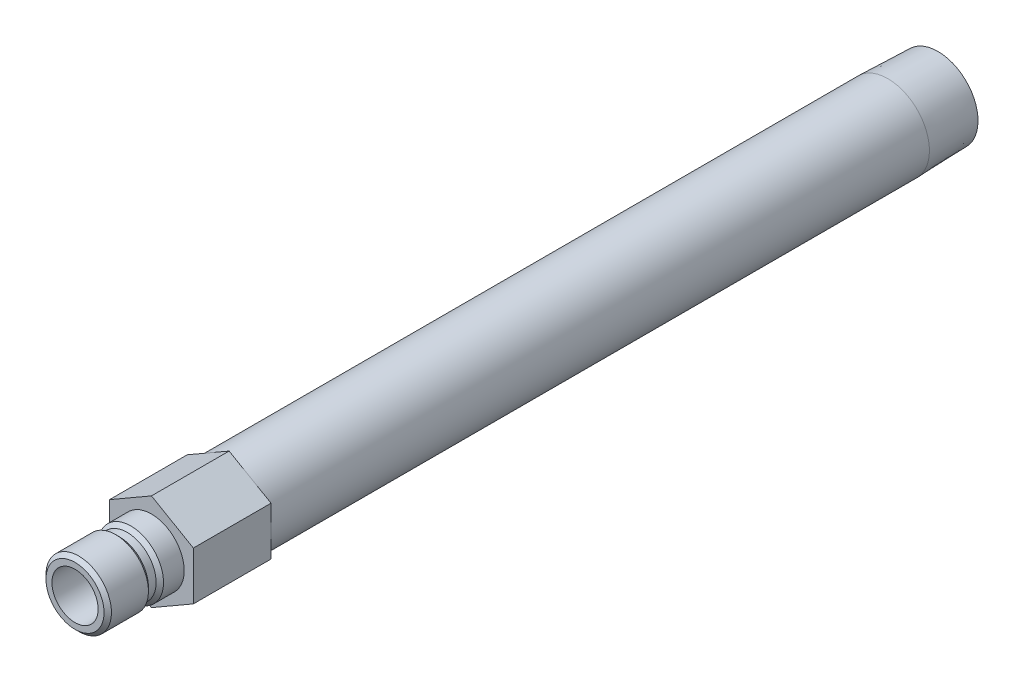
ISO-10303-21;
HEADER;
FILE_DESCRIPTION(('STEP AP214'),'2;1');
FILE_NAME('part.step','',(''),(''),'','','');
FILE_SCHEMA(('AUTOMOTIVE_DESIGN { 1 0 10303 214 1 1 1 1 }'));
ENDSEC;
DATA;
#1=APPLICATION_CONTEXT('core data for automotive mechanical design processes');
#2=APPLICATION_PROTOCOL_DEFINITION('international standard','automotive_design',2000,#1);
#3=PRODUCT_CONTEXT('',#1,'mechanical');
#4=PRODUCT('Part','Part','',(#3));
#5=PRODUCT_RELATED_PRODUCT_CATEGORY('part','',(#4));
#6=PRODUCT_DEFINITION_FORMATION('','',#4);
#7=PRODUCT_DEFINITION_CONTEXT('part definition',#1,'design');
#8=PRODUCT_DEFINITION('design','',#6,#7);
#9=PRODUCT_DEFINITION_SHAPE('','',#8);
#10=(LENGTH_UNIT() NAMED_UNIT(*) SI_UNIT(.MILLI.,.METRE.));
#11=(NAMED_UNIT(*) PLANE_ANGLE_UNIT() SI_UNIT($,.RADIAN.));
#12=(NAMED_UNIT(*) SI_UNIT($,.STERADIAN.) SOLID_ANGLE_UNIT());
#13=UNCERTAINTY_MEASURE_WITH_UNIT(LENGTH_MEASURE(1.E-05),#10,'distance_accuracy_value','');
#14=(GEOMETRIC_REPRESENTATION_CONTEXT(3) GLOBAL_UNCERTAINTY_ASSIGNED_CONTEXT((#13)) GLOBAL_UNIT_ASSIGNED_CONTEXT((#10,
#11,#12)) REPRESENTATION_CONTEXT('',''));
#15=CARTESIAN_POINT('',(0.,0.,0.));
#16=DIRECTION('',(0.,0.,1.));
#17=DIRECTION('',(1.,0.,0.));
#18=AXIS2_PLACEMENT_3D('',#15,#16,#17);
#19=CARTESIAN_POINT('',(0.,0.,0.));
#20=DIRECTION('',(0.,0.,-1.));
#21=DIRECTION('',(0.,1.,0.));
#22=AXIS2_PLACEMENT_3D('',#19,#20,#21);
#23=CYLINDRICAL_SURFACE('',#22,8.57249999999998);
#24=CARTESIAN_POINT('',(0.,0.,-151.7142));
#25=DIRECTION('',(0.,0.,-1.));
#26=DIRECTION('',(0.,1.,0.));
#27=AXIS2_PLACEMENT_3D('',#24,#25,#26);
#28=CIRCLE('',#27,8.57249999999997);
#29=CARTESIAN_POINT('',(0.,8.5725,-151.7142));
#30=VERTEX_POINT('',#29);
#31=EDGE_CURVE('E168',#30,#30,#28,.T.);
#32=ORIENTED_EDGE('',*,*,#31,.F.);
#33=EDGE_LOOP('',(#32));
#34=FACE_BOUND('',#33,.T.);
#35=CARTESIAN_POINT('',(0.,0.,-16.002));
#36=DIRECTION('',(0.,0.,1.));
#37=DIRECTION('',(1.,0.,0.));
#38=AXIS2_PLACEMENT_3D('',#35,#36,#37);
#39=CIRCLE('',#38,8.57249999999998);
#40=CARTESIAN_POINT('',(8.57249999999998,0.,-16.002));
#41=VERTEX_POINT('',#40);
#42=EDGE_CURVE('E37',#41,#41,#39,.F.);
#43=ORIENTED_EDGE('',*,*,#42,.T.);
#44=EDGE_LOOP('',(#43));
#45=FACE_BOUND('',#44,.T.);
#46=ADVANCED_FACE('F33',(#34,#45),#23,.T.);
#47=CARTESIAN_POINT('',(0.,0.,0.));
#48=DIRECTION('',(0.,0.,-1.));
#49=DIRECTION('',(0.,1.,0.));
#50=AXIS2_PLACEMENT_3D('',#47,#48,#49);
#51=CYLINDRICAL_SURFACE('',#50,4.7625);
#52=CARTESIAN_POINT('',(0.,0.,15.748));
#53=DIRECTION('',(0.,0.,-1.));
#54=DIRECTION('',(0.,1.,0.));
#55=AXIS2_PLACEMENT_3D('',#52,#53,#54);
#56=CIRCLE('',#55,4.7625);
#57=CARTESIAN_POINT('',(0.,4.7625,15.748));
#58=VERTEX_POINT('',#57);
#59=EDGE_CURVE('E144',#58,#58,#56,.T.);
#60=ORIENTED_EDGE('',*,*,#59,.F.);
#61=EDGE_LOOP('',(#60));
#62=FACE_BOUND('',#61,.T.);
#63=CARTESIAN_POINT('',(0.,0.,-16.002));
#64=DIRECTION('',(0.,0.,-1.));
#65=DIRECTION('',(0.,1.,0.));
#66=AXIS2_PLACEMENT_3D('',#63,#64,#65);
#67=CIRCLE('',#66,4.76249999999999);
#68=CARTESIAN_POINT('',(0.,4.7625,-16.002));
#69=VERTEX_POINT('',#68);
#70=EDGE_CURVE('E11',#69,#69,#67,.T.);
#71=ORIENTED_EDGE('',*,*,#70,.T.);
#72=EDGE_LOOP('',(#71));
#73=FACE_BOUND('',#72,.T.);
#74=ADVANCED_FACE('F35',(#62,#73),#51,.F.);
#75=CARTESIAN_POINT('',(0.,4.7625,-16.002));
#76=DIRECTION('',(0.,0.,-1.));
#77=DIRECTION('',(0.,1.,0.));
#78=AXIS2_PLACEMENT_3D('',#75,#76,#77);
#79=PLANE('',#78);
#80=CARTESIAN_POINT('',(0.,0.,-16.002));
#81=DIRECTION('',(0.,0.,-1.));
#82=DIRECTION('',(0.,1.,0.));
#83=AXIS2_PLACEMENT_3D('',#80,#81,#82);
#84=CIRCLE('',#83,6.26109999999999);
#85=CARTESIAN_POINT('',(0.,6.2611,-16.002));
#86=VERTEX_POINT('',#85);
#87=EDGE_CURVE('E43',#86,#86,#84,.T.);
#88=ORIENTED_EDGE('',*,*,#87,.T.);
#89=EDGE_LOOP('',(#88));
#90=FACE_BOUND('',#89,.T.);
#91=ORIENTED_EDGE('',*,*,#70,.F.);
#92=EDGE_LOOP('',(#91));
#93=FACE_BOUND('',#92,.T.);
#94=ADVANCED_FACE('F180',(#90,#93),#79,.T.);
#95=CARTESIAN_POINT('',(0.,0.,0.));
#96=DIRECTION('',(0.,0.,-1.));
#97=DIRECTION('',(0.,1.,0.));
#98=AXIS2_PLACEMENT_3D('',#95,#96,#97);
#99=CYLINDRICAL_SURFACE('',#98,6.26109999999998);
#100=CARTESIAN_POINT('',(0.,0.,-162.052));
#101=DIRECTION('',(0.,0.,-1.));
#102=DIRECTION('',(0.,1.,0.));
#103=AXIS2_PLACEMENT_3D('',#100,#101,#102);
#104=CIRCLE('',#103,6.26109999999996);
#105=CARTESIAN_POINT('',(0.,6.2611,-162.052));
#106=VERTEX_POINT('',#105);
#107=EDGE_CURVE('E174',#106,#106,#104,.T.);
#108=ORIENTED_EDGE('',*,*,#107,.T.);
#109=EDGE_LOOP('',(#108));
#110=FACE_BOUND('',#109,.T.);
#111=ORIENTED_EDGE('',*,*,#87,.F.);
#112=EDGE_LOOP('',(#111));
#113=FACE_BOUND('',#112,.T.);
#114=ADVANCED_FACE('F183',(#110,#113),#99,.F.);
#115=CARTESIAN_POINT('',(0.,8.24944566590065,-162.052));
#116=DIRECTION('',(0.,0.,-1.));
#117=DIRECTION('',(0.,1.,0.));
#118=AXIS2_PLACEMENT_3D('',#115,#116,#117);
#119=PLANE('',#118);
#120=CARTESIAN_POINT('',(0.,0.,-162.052));
#121=DIRECTION('',(0.,0.,-1.));
#122=DIRECTION('',(0.,1.,0.));
#123=AXIS2_PLACEMENT_3D('',#120,#121,#122);
#124=CIRCLE('',#123,8.24944566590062);
#125=CARTESIAN_POINT('',(0.,8.24944566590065,-162.052));
#126=VERTEX_POINT('',#125);
#127=EDGE_CURVE('E171',#126,#126,#124,.T.);
#128=ORIENTED_EDGE('',*,*,#127,.T.);
#129=EDGE_LOOP('',(#128));
#130=FACE_BOUND('',#129,.T.);
#131=ORIENTED_EDGE('',*,*,#107,.F.);
#132=EDGE_LOOP('',(#131));
#133=FACE_BOUND('',#132,.T.);
#134=ADVANCED_FACE('F185',(#130,#133),#119,.T.);
#135=CARTESIAN_POINT('',(0.,0.,-162.052));
#136=DIRECTION('',(0.,0.,1.));
#137=DIRECTION('',(0.,-1.,0.));
#138=AXIS2_PLACEMENT_3D('',#135,#136,#137);
#139=CONICAL_SURFACE('',#138,8.24944566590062,0.0312396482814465);
#140=ORIENTED_EDGE('',*,*,#31,.T.);
#141=EDGE_LOOP('',(#140));
#142=FACE_BOUND('',#141,.T.);
#143=ORIENTED_EDGE('',*,*,#127,.F.);
#144=EDGE_LOOP('',(#143));
#145=FACE_BOUND('',#144,.T.);
#146=ADVANCED_FACE('F192',(#142,#145),#139,.T.);
#147=CARTESIAN_POINT('',(0.,6.7437,0.));
#148=DIRECTION('',(0.,0.,1.));
#149=DIRECTION('',(0.,-1.,0.));
#150=AXIS2_PLACEMENT_3D('',#147,#148,#149);
#151=PLANE('',#150);
#152=CARTESIAN_POINT('',(0.,0.,0.));
#153=DIRECTION('',(0.,0.,-1.));
#154=DIRECTION('',(0.,1.,0.));
#155=AXIS2_PLACEMENT_3D('',#152,#153,#154);
#156=CIRCLE('',#155,6.7437);
#157=CARTESIAN_POINT('',(0.,6.7437,0.));
#158=VERTEX_POINT('',#157);
#159=EDGE_CURVE('E165',#158,#158,#156,.T.);
#160=ORIENTED_EDGE('',*,*,#159,.T.);
#161=EDGE_LOOP('',(#160));
#162=FACE_BOUND('',#161,.T.);
#163=DIRECTION('',(-0.866025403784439,-0.5,0.));
#164=VECTOR('',#163,1.);
#165=CARTESIAN_POINT('',(0.,9.97199384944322,0.));
#166=LINE('',#165,#164);
#167=CARTESIAN_POINT('',(0.,9.97199384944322,0.));
#168=VERTEX_POINT('',#167);
#169=CARTESIAN_POINT('',(-8.636,4.98599692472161,0.));
#170=VERTEX_POINT('',#169);
#171=EDGE_CURVE('E122',#168,#170,#166,.T.);
#172=ORIENTED_EDGE('',*,*,#171,.T.);
#173=DIRECTION('',(0.,-1.,0.));
#174=VECTOR('',#173,1.);
#175=CARTESIAN_POINT('',(-8.636,4.98599692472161,0.));
#176=LINE('',#175,#174);
#177=CARTESIAN_POINT('',(-8.636,-4.98599692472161,0.));
#178=VERTEX_POINT('',#177);
#179=EDGE_CURVE('E125',#170,#178,#176,.T.);
#180=ORIENTED_EDGE('',*,*,#179,.T.);
#181=DIRECTION('',(0.866025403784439,-0.5,0.));
#182=VECTOR('',#181,1.);
#183=CARTESIAN_POINT('',(-8.636,-4.98599692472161,0.));
#184=LINE('',#183,#182);
#185=CARTESIAN_POINT('',(0.,-9.97199384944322,0.));
#186=VERTEX_POINT('',#185);
#187=EDGE_CURVE('E128',#178,#186,#184,.T.);
#188=ORIENTED_EDGE('',*,*,#187,.T.);
#189=DIRECTION('',(0.866025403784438,0.5,0.));
#190=VECTOR('',#189,1.);
#191=CARTESIAN_POINT('',(0.,-9.97199384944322,0.));
#192=LINE('',#191,#190);
#193=CARTESIAN_POINT('',(8.63599999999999,-4.98599692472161,0.));
#194=VERTEX_POINT('',#193);
#195=EDGE_CURVE('E131',#186,#194,#192,.T.);
#196=ORIENTED_EDGE('',*,*,#195,.T.);
#197=DIRECTION('',(0.,1.,0.));
#198=VECTOR('',#197,1.);
#199=CARTESIAN_POINT('',(8.63599999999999,-4.98599692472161,0.));
#200=LINE('',#199,#198);
#201=CARTESIAN_POINT('',(8.636,4.98599692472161,0.));
#202=VERTEX_POINT('',#201);
#203=EDGE_CURVE('E99',#194,#202,#200,.T.);
#204=ORIENTED_EDGE('',*,*,#203,.T.);
#205=DIRECTION('',(-0.866025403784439,0.5,0.));
#206=VECTOR('',#205,1.);
#207=CARTESIAN_POINT('',(8.636,4.98599692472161,0.));
#208=LINE('',#207,#206);
#209=EDGE_CURVE('E134',#202,#168,#208,.T.);
#210=ORIENTED_EDGE('',*,*,#209,.T.);
#211=EDGE_LOOP('',(#172,#180,#188,#196,#204,#210));
#212=FACE_BOUND('',#211,.T.);
#213=ADVANCED_FACE('F206',(#162,#212),#151,.T.);
#214=CARTESIAN_POINT('',(0.,0.,0.));
#215=DIRECTION('',(0.,0.,-1.));
#216=DIRECTION('',(0.,1.,0.));
#217=AXIS2_PLACEMENT_3D('',#214,#215,#216);
#218=CYLINDRICAL_SURFACE('',#217,6.7437);
#219=CARTESIAN_POINT('',(0.,0.,4.25449999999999));
#220=DIRECTION('',(0.,0.,-1.));
#221=DIRECTION('',(0.,1.,0.));
#222=AXIS2_PLACEMENT_3D('',#219,#220,#221);
#223=CIRCLE('',#222,6.7437);
#224=CARTESIAN_POINT('',(0.,6.7437,4.2545));
#225=VERTEX_POINT('',#224);
#226=EDGE_CURVE('E162',#225,#225,#223,.T.);
#227=ORIENTED_EDGE('',*,*,#226,.T.);
#228=EDGE_LOOP('',(#227));
#229=FACE_BOUND('',#228,.T.);
#230=ORIENTED_EDGE('',*,*,#159,.F.);
#231=EDGE_LOOP('',(#230));
#232=FACE_BOUND('',#231,.T.);
#233=ADVANCED_FACE('F213',(#229,#232),#218,.T.);
#234=CARTESIAN_POINT('',(0.,0.,4.25449999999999));
#235=DIRECTION('',(0.,0.,-1.));
#236=DIRECTION('',(0.,1.,0.));
#237=AXIS2_PLACEMENT_3D('',#234,#235,#236);
#238=CONICAL_SURFACE('',#237,6.7437,0.785398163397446);
#239=CARTESIAN_POINT('',(0.,0.,5.0165));
#240=DIRECTION('',(0.,0.,-1.));
#241=DIRECTION('',(0.,1.,0.));
#242=AXIS2_PLACEMENT_3D('',#239,#240,#241);
#243=CIRCLE('',#242,5.9817);
#244=CARTESIAN_POINT('',(0.,5.9817,5.0165));
#245=VERTEX_POINT('',#244);
#246=EDGE_CURVE('E159',#245,#245,#243,.T.);
#247=ORIENTED_EDGE('',*,*,#246,.T.);
#248=EDGE_LOOP('',(#247));
#249=FACE_BOUND('',#248,.T.);
#250=ORIENTED_EDGE('',*,*,#226,.F.);
#251=EDGE_LOOP('',(#250));
#252=FACE_BOUND('',#251,.T.);
#253=ADVANCED_FACE('F222',(#249,#252),#238,.T.);
#254=CARTESIAN_POINT('',(0.,0.,0.));
#255=DIRECTION('',(0.,0.,-1.));
#256=DIRECTION('',(0.,1.,0.));
#257=AXIS2_PLACEMENT_3D('',#254,#255,#256);
#258=CYLINDRICAL_SURFACE('',#257,5.9817);
#259=CARTESIAN_POINT('',(0.,0.,6.604));
#260=DIRECTION('',(0.,0.,-1.));
#261=DIRECTION('',(0.,1.,0.));
#262=AXIS2_PLACEMENT_3D('',#259,#260,#261);
#263=CIRCLE('',#262,5.9817);
#264=CARTESIAN_POINT('',(0.,5.9817,6.604));
#265=VERTEX_POINT('',#264);
#266=EDGE_CURVE('E156',#265,#265,#263,.T.);
#267=ORIENTED_EDGE('',*,*,#266,.T.);
#268=EDGE_LOOP('',(#267));
#269=FACE_BOUND('',#268,.T.);
#270=ORIENTED_EDGE('',*,*,#246,.F.);
#271=EDGE_LOOP('',(#270));
#272=FACE_BOUND('',#271,.T.);
#273=ADVANCED_FACE('F263',(#269,#272),#258,.T.);
#274=CARTESIAN_POINT('',(0.,0.,6.604));
#275=DIRECTION('',(0.,0.,1.));
#276=DIRECTION('',(0.,-1.,0.));
#277=AXIS2_PLACEMENT_3D('',#274,#275,#276);
#278=CONICAL_SURFACE('',#277,5.9817,0.785398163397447);
#279=CARTESIAN_POINT('',(0.,0.,7.366));
#280=DIRECTION('',(0.,0.,-1.));
#281=DIRECTION('',(0.,1.,0.));
#282=AXIS2_PLACEMENT_3D('',#279,#280,#281);
#283=CIRCLE('',#282,6.7437);
#284=CARTESIAN_POINT('',(0.,6.7437,7.366));
#285=VERTEX_POINT('',#284);
#286=EDGE_CURVE('E153',#285,#285,#283,.T.);
#287=ORIENTED_EDGE('',*,*,#286,.T.);
#288=EDGE_LOOP('',(#287));
#289=FACE_BOUND('',#288,.T.);
#290=ORIENTED_EDGE('',*,*,#266,.F.);
#291=EDGE_LOOP('',(#290));
#292=FACE_BOUND('',#291,.T.);
#293=ADVANCED_FACE('F259',(#289,#292),#278,.T.);
#294=CARTESIAN_POINT('',(0.,0.,0.));
#295=DIRECTION('',(0.,0.,-1.));
#296=DIRECTION('',(0.,1.,0.));
#297=AXIS2_PLACEMENT_3D('',#294,#295,#296);
#298=CYLINDRICAL_SURFACE('',#297,6.7437);
#299=CARTESIAN_POINT('',(0.,0.,14.986));
#300=DIRECTION('',(0.,0.,-1.));
#301=DIRECTION('',(0.,1.,0.));
#302=AXIS2_PLACEMENT_3D('',#299,#300,#301);
#303=CIRCLE('',#302,6.7437);
#304=CARTESIAN_POINT('',(0.,6.7437,14.986));
#305=VERTEX_POINT('',#304);
#306=EDGE_CURVE('E150',#305,#305,#303,.T.);
#307=ORIENTED_EDGE('',*,*,#306,.T.);
#308=EDGE_LOOP('',(#307));
#309=FACE_BOUND('',#308,.T.);
#310=ORIENTED_EDGE('',*,*,#286,.F.);
#311=EDGE_LOOP('',(#310));
#312=FACE_BOUND('',#311,.T.);
#313=ADVANCED_FACE('F255',(#309,#312),#298,.T.);
#314=CARTESIAN_POINT('',(0.,0.,14.986));
#315=DIRECTION('',(0.,0.,-1.));
#316=DIRECTION('',(0.,1.,0.));
#317=AXIS2_PLACEMENT_3D('',#314,#315,#316);
#318=CONICAL_SURFACE('',#317,6.7437,0.785398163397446);
#319=CARTESIAN_POINT('',(0.,0.,15.748));
#320=DIRECTION('',(0.,0.,-1.));
#321=DIRECTION('',(0.,1.,0.));
#322=AXIS2_PLACEMENT_3D('',#319,#320,#321);
#323=CIRCLE('',#322,5.9817);
#324=CARTESIAN_POINT('',(0.,5.9817,15.748));
#325=VERTEX_POINT('',#324);
#326=EDGE_CURVE('E147',#325,#325,#323,.T.);
#327=ORIENTED_EDGE('',*,*,#326,.T.);
#328=EDGE_LOOP('',(#327));
#329=FACE_BOUND('',#328,.T.);
#330=ORIENTED_EDGE('',*,*,#306,.F.);
#331=EDGE_LOOP('',(#330));
#332=FACE_BOUND('',#331,.T.);
#333=ADVANCED_FACE('F251',(#329,#332),#318,.T.);
#334=CARTESIAN_POINT('',(0.,4.7625,15.748));
#335=DIRECTION('',(0.,0.,1.));
#336=DIRECTION('',(0.,-1.,0.));
#337=AXIS2_PLACEMENT_3D('',#334,#335,#336);
#338=PLANE('',#337);
#339=ORIENTED_EDGE('',*,*,#59,.T.);
#340=EDGE_LOOP('',(#339));
#341=FACE_BOUND('',#340,.T.);
#342=ORIENTED_EDGE('',*,*,#326,.F.);
#343=EDGE_LOOP('',(#342));
#344=FACE_BOUND('',#343,.T.);
#345=ADVANCED_FACE('F239',(#341,#344),#338,.T.);
#346=CARTESIAN_POINT('',(0.,9.97199384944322,-16.002));
#347=DIRECTION('',(-0.5,0.866025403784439,0.));
#348=DIRECTION('',(-0.866025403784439,-0.5,0.));
#349=AXIS2_PLACEMENT_3D('',#346,#347,#348);
#350=PLANE('',#349);
#351=ORIENTED_EDGE('',*,*,#171,.F.);
#352=DIRECTION('',(0.,0.,1.));
#353=VECTOR('',#352,1.);
#354=CARTESIAN_POINT('',(0.,9.97199384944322,-16.002));
#355=LINE('',#354,#353);
#356=CARTESIAN_POINT('',(0.,9.97199384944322,-16.002));
#357=VERTEX_POINT('',#356);
#358=EDGE_CURVE('E51',#357,#168,#355,.T.);
#359=ORIENTED_EDGE('',*,*,#358,.F.);
#360=DIRECTION('',(-0.866025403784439,-0.5,0.));
#361=VECTOR('',#360,1.);
#362=CARTESIAN_POINT('',(0.,9.97199384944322,-16.002));
#363=LINE('',#362,#361);
#364=CARTESIAN_POINT('',(-8.636,4.98599692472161,-16.002));
#365=VERTEX_POINT('',#364);
#366=EDGE_CURVE('E137',#357,#365,#363,.T.);
#367=ORIENTED_EDGE('',*,*,#366,.T.);
#368=DIRECTION('',(0.,0.,1.));
#369=VECTOR('',#368,1.);
#370=CARTESIAN_POINT('',(-8.636,4.98599692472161,-16.002));
#371=LINE('',#370,#369);
#372=EDGE_CURVE('E86',#365,#170,#371,.T.);
#373=ORIENTED_EDGE('',*,*,#372,.T.);
#374=EDGE_LOOP('',(#351,#359,#367,#373));
#375=FACE_BOUND('',#374,.T.);
#376=ADVANCED_FACE('F226',(#375),#350,.T.);
#377=CARTESIAN_POINT('',(8.636,4.98599692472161,-16.002));
#378=DIRECTION('',(0.5,0.866025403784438,0.));
#379=DIRECTION('',(-0.866025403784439,0.5,0.));
#380=AXIS2_PLACEMENT_3D('',#377,#378,#379);
#381=PLANE('',#380);
#382=ORIENTED_EDGE('',*,*,#209,.F.);
#383=DIRECTION('',(0.,0.,1.));
#384=VECTOR('',#383,1.);
#385=CARTESIAN_POINT('',(8.636,4.98599692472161,-16.002));
#386=LINE('',#385,#384);
#387=CARTESIAN_POINT('',(8.636,4.98599692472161,-16.002));
#388=VERTEX_POINT('',#387);
#389=EDGE_CURVE('E74',#388,#202,#386,.T.);
#390=ORIENTED_EDGE('',*,*,#389,.F.);
#391=DIRECTION('',(-0.866025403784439,0.5,0.));
#392=VECTOR('',#391,1.);
#393=CARTESIAN_POINT('',(8.636,4.98599692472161,-16.002));
#394=LINE('',#393,#392);
#395=EDGE_CURVE('E112',#388,#357,#394,.T.);
#396=ORIENTED_EDGE('',*,*,#395,.T.);
#397=ORIENTED_EDGE('',*,*,#358,.T.);
#398=EDGE_LOOP('',(#382,#390,#396,#397));
#399=FACE_BOUND('',#398,.T.);
#400=ADVANCED_FACE('F231',(#399),#381,.T.);
#401=CARTESIAN_POINT('',(8.63599999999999,-4.98599692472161,-16.002));
#402=DIRECTION('',(1.,0.,0.));
#403=DIRECTION('',(0.,1.,0.));
#404=AXIS2_PLACEMENT_3D('',#401,#402,#403);
#405=PLANE('',#404);
#406=ORIENTED_EDGE('',*,*,#203,.F.);
#407=DIRECTION('',(0.,0.,1.));
#408=VECTOR('',#407,1.);
#409=CARTESIAN_POINT('',(8.63599999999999,-4.98599692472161,-16.002));
#410=LINE('',#409,#408);
#411=CARTESIAN_POINT('',(8.63599999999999,-4.98599692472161,-16.002));
#412=VERTEX_POINT('',#411);
#413=EDGE_CURVE('E94',#412,#194,#410,.T.);
#414=ORIENTED_EDGE('',*,*,#413,.F.);
#415=DIRECTION('',(0.,1.,0.));
#416=VECTOR('',#415,1.);
#417=CARTESIAN_POINT('',(8.63599999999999,-4.98599692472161,-16.002));
#418=LINE('',#417,#416);
#419=EDGE_CURVE('E97',#412,#388,#418,.T.);
#420=ORIENTED_EDGE('',*,*,#419,.T.);
#421=ORIENTED_EDGE('',*,*,#389,.T.);
#422=EDGE_LOOP('',(#406,#414,#420,#421));
#423=FACE_BOUND('',#422,.T.);
#424=ADVANCED_FACE('F96',(#423),#405,.T.);
#425=CARTESIAN_POINT('',(0.,-9.97199384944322,-16.002));
#426=DIRECTION('',(0.5,-0.866025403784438,0.));
#427=DIRECTION('',(0.866025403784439,0.5,0.));
#428=AXIS2_PLACEMENT_3D('',#425,#426,#427);
#429=PLANE('',#428);
#430=ORIENTED_EDGE('',*,*,#195,.F.);
#431=DIRECTION('',(0.,0.,1.));
#432=VECTOR('',#431,1.);
#433=CARTESIAN_POINT('',(0.,-9.97199384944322,-16.002));
#434=LINE('',#433,#432);
#435=CARTESIAN_POINT('',(0.,-9.97199384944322,-16.002));
#436=VERTEX_POINT('',#435);
#437=EDGE_CURVE('E104',#436,#186,#434,.T.);
#438=ORIENTED_EDGE('',*,*,#437,.F.);
#439=DIRECTION('',(0.866025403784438,0.5,0.));
#440=VECTOR('',#439,1.);
#441=CARTESIAN_POINT('',(0.,-9.97199384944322,-16.002));
#442=LINE('',#441,#440);
#443=EDGE_CURVE('E110',#436,#412,#442,.T.);
#444=ORIENTED_EDGE('',*,*,#443,.T.);
#445=ORIENTED_EDGE('',*,*,#413,.T.);
#446=EDGE_LOOP('',(#430,#438,#444,#445));
#447=FACE_BOUND('',#446,.T.);
#448=ADVANCED_FACE('F114',(#447),#429,.T.);
#449=CARTESIAN_POINT('',(-8.636,-4.98599692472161,-16.002));
#450=DIRECTION('',(-0.5,-0.866025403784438,0.));
#451=DIRECTION('',(0.866025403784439,-0.5,0.));
#452=AXIS2_PLACEMENT_3D('',#449,#450,#451);
#453=PLANE('',#452);
#454=ORIENTED_EDGE('',*,*,#187,.F.);
#455=DIRECTION('',(0.,0.,1.));
#456=VECTOR('',#455,1.);
#457=CARTESIAN_POINT('',(-8.636,-4.98599692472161,-16.002));
#458=LINE('',#457,#456);
#459=CARTESIAN_POINT('',(-8.636,-4.98599692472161,-16.002));
#460=VERTEX_POINT('',#459);
#461=EDGE_CURVE('E141',#460,#178,#458,.T.);
#462=ORIENTED_EDGE('',*,*,#461,.F.);
#463=DIRECTION('',(0.866025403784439,-0.5,0.));
#464=VECTOR('',#463,1.);
#465=CARTESIAN_POINT('',(-8.636,-4.98599692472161,-16.002));
#466=LINE('',#465,#464);
#467=EDGE_CURVE('E115',#460,#436,#466,.T.);
#468=ORIENTED_EDGE('',*,*,#467,.T.);
#469=ORIENTED_EDGE('',*,*,#437,.T.);
#470=EDGE_LOOP('',(#454,#462,#468,#469));
#471=FACE_BOUND('',#470,.T.);
#472=ADVANCED_FACE('F230',(#471),#453,.T.);
#473=CARTESIAN_POINT('',(-8.636,4.98599692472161,-16.002));
#474=DIRECTION('',(-1.,0.,0.));
#475=DIRECTION('',(0.,0.,1.));
#476=AXIS2_PLACEMENT_3D('',#473,#474,#475);
#477=PLANE('',#476);
#478=ORIENTED_EDGE('',*,*,#179,.F.);
#479=ORIENTED_EDGE('',*,*,#372,.F.);
#480=DIRECTION('',(0.,-1.,0.));
#481=VECTOR('',#480,1.);
#482=CARTESIAN_POINT('',(-8.636,4.98599692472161,-16.002));
#483=LINE('',#482,#481);
#484=EDGE_CURVE('E117',#365,#460,#483,.T.);
#485=ORIENTED_EDGE('',*,*,#484,.T.);
#486=ORIENTED_EDGE('',*,*,#461,.T.);
#487=EDGE_LOOP('',(#478,#479,#485,#486));
#488=FACE_BOUND('',#487,.T.);
#489=ADVANCED_FACE('F227',(#488),#477,.T.);
#490=CARTESIAN_POINT('',(-8.636,4.98599692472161,-16.002));
#491=DIRECTION('',(0.,0.,1.));
#492=DIRECTION('',(1.,0.,0.));
#493=AXIS2_PLACEMENT_3D('',#490,#491,#492);
#494=PLANE('',#493);
#495=ORIENTED_EDGE('',*,*,#42,.F.);
#496=EDGE_LOOP('',(#495));
#497=FACE_BOUND('',#496,.T.);
#498=ORIENTED_EDGE('',*,*,#366,.F.);
#499=ORIENTED_EDGE('',*,*,#395,.F.);
#500=ORIENTED_EDGE('',*,*,#419,.F.);
#501=ORIENTED_EDGE('',*,*,#443,.F.);
#502=ORIENTED_EDGE('',*,*,#467,.F.);
#503=ORIENTED_EDGE('',*,*,#484,.F.);
#504=EDGE_LOOP('',(#498,#499,#500,#501,#502,#503));
#505=FACE_BOUND('',#504,.T.);
#506=ADVANCED_FACE('F108',(#497,#505),#494,.F.);
#507=CLOSED_SHELL('',(#46,#74,#94,#114,#134,#146,#213,#233,#253,#273,#293,#313,#333,#345,#376,
#400,#424,#448,#472,#489,#506));
#508=MANIFOLD_SOLID_BREP('B2',#507);
#509=ADVANCED_BREP_SHAPE_REPRESENTATION('',(#18,#508),#14);
#510=SHAPE_DEFINITION_REPRESENTATION(#9,#509);
ENDSEC;
END-ISO-10303-21;
